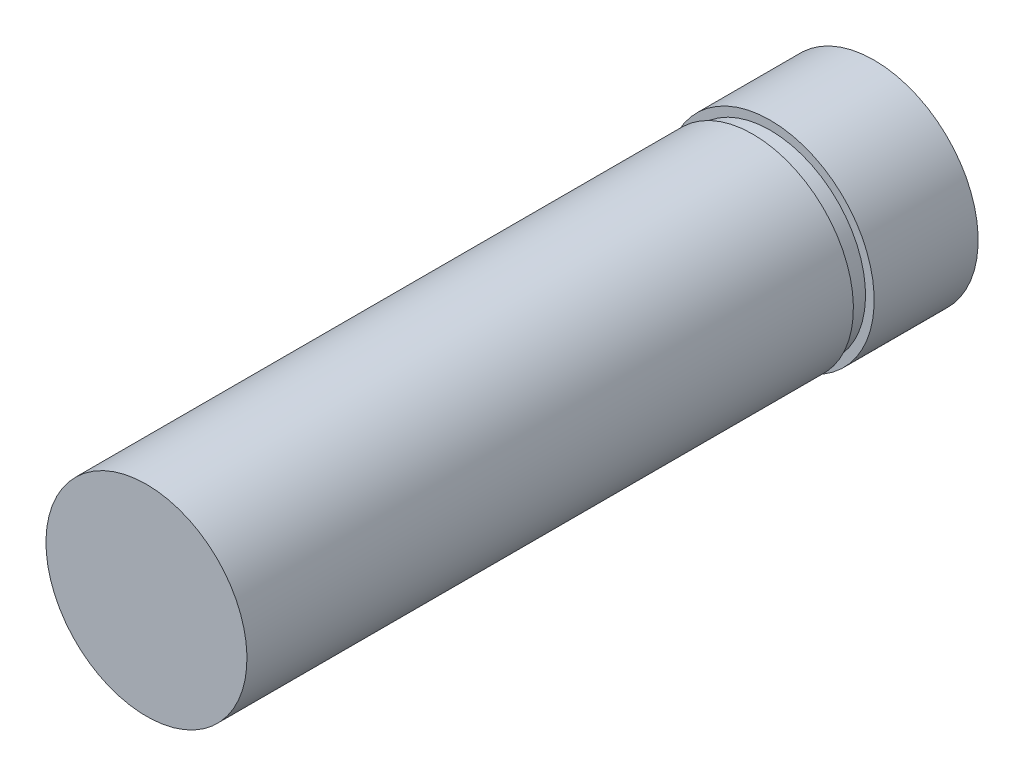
from build123d import *


with BuildPart() as part:
    # Sketch1 → Revolve1 (revolve)
    with BuildSketch(Plane.XZ, mode=Mode.PRIVATE) as revolve1_sk:
        Polygon((2.75, 0.1), (2.9, 0.1), (2.9, 17.6), (0, 17.6), (0, -3.4), (3, -3.4), (3, -0.4), (2.75, -0.4), align=None)
    revolve(revolve1_sk.sketch.rotate(Axis((0, 0, 17.6), (0, 0, -1)), 270), axis=Axis((0, 0, 17.6), (0, 0, -1)))


solid = part.part
